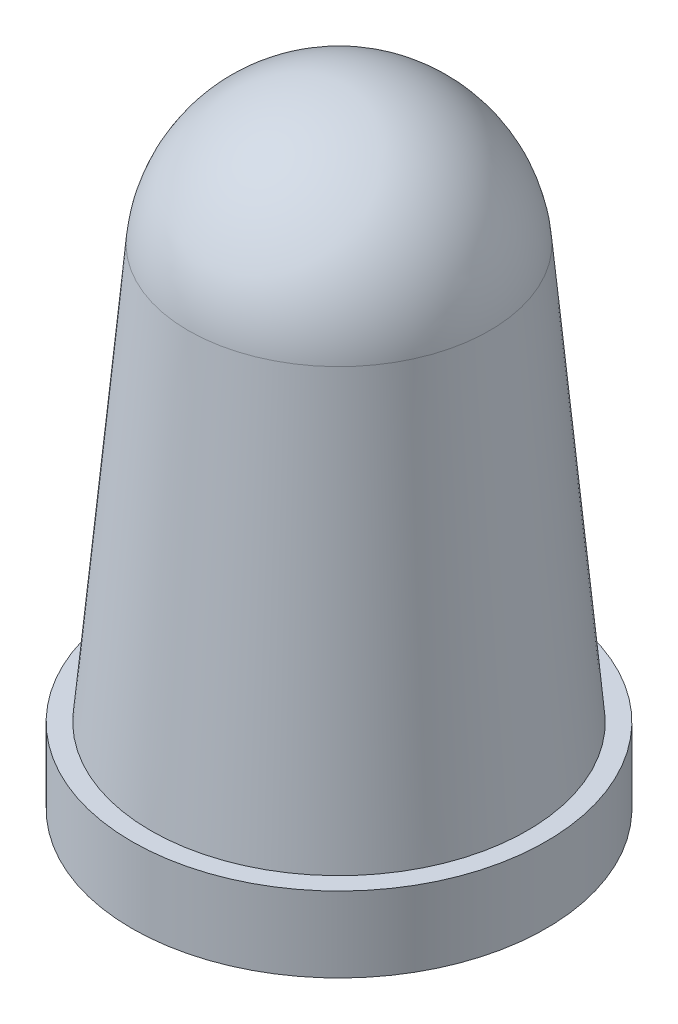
ISO-10303-21;
HEADER;
FILE_DESCRIPTION(('STEP AP214'),'2;1');
FILE_NAME('part.step','',(''),(''),'','','');
FILE_SCHEMA(('AUTOMOTIVE_DESIGN { 1 0 10303 214 1 1 1 1 }'));
ENDSEC;
DATA;
#1=APPLICATION_CONTEXT('core data for automotive mechanical design processes');
#2=APPLICATION_PROTOCOL_DEFINITION('international standard','automotive_design',2000,#1);
#3=PRODUCT_CONTEXT('',#1,'mechanical');
#4=PRODUCT('Part','Part','',(#3));
#5=PRODUCT_RELATED_PRODUCT_CATEGORY('part','',(#4));
#6=PRODUCT_DEFINITION_FORMATION('','',#4);
#7=PRODUCT_DEFINITION_CONTEXT('part definition',#1,'design');
#8=PRODUCT_DEFINITION('design','',#6,#7);
#9=PRODUCT_DEFINITION_SHAPE('','',#8);
#10=(LENGTH_UNIT() NAMED_UNIT(*) SI_UNIT(.MILLI.,.METRE.));
#11=(NAMED_UNIT(*) PLANE_ANGLE_UNIT() SI_UNIT($,.RADIAN.));
#12=(NAMED_UNIT(*) SI_UNIT($,.STERADIAN.) SOLID_ANGLE_UNIT());
#13=UNCERTAINTY_MEASURE_WITH_UNIT(LENGTH_MEASURE(1.E-05),#10,'distance_accuracy_value','');
#14=(GEOMETRIC_REPRESENTATION_CONTEXT(3) GLOBAL_UNCERTAINTY_ASSIGNED_CONTEXT((#13)) GLOBAL_UNIT_ASSIGNED_CONTEXT((#10,
#11,#12)) REPRESENTATION_CONTEXT('',''));
#15=CARTESIAN_POINT('',(0.,0.,0.));
#16=DIRECTION('',(0.,0.,1.));
#17=DIRECTION('',(1.,0.,0.));
#18=AXIS2_PLACEMENT_3D('',#15,#16,#17);
#19=CARTESIAN_POINT('',(0.,0.,0.));
#20=DIRECTION('',(0.,-1.,0.));
#21=DIRECTION('',(0.,0.,-1.));
#22=AXIS2_PLACEMENT_3D('',#19,#20,#21);
#23=PLANE('',#22);
#24=CARTESIAN_POINT('',(0.,0.,0.));
#25=DIRECTION('',(0.,-1.,0.));
#26=DIRECTION('',(0.,0.,-1.));
#27=AXIS2_PLACEMENT_3D('',#24,#25,#26);
#28=CIRCLE('',#27,2.75);
#29=CARTESIAN_POINT('',(0.,0.,-2.75));
#30=VERTEX_POINT('',#29);
#31=EDGE_CURVE('E11',#30,#30,#28,.T.);
#32=ORIENTED_EDGE('',*,*,#31,.T.);
#33=EDGE_LOOP('',(#32));
#34=FACE_BOUND('',#33,.T.);
#35=ADVANCED_FACE('F32',(#34),#23,.T.);
#36=CARTESIAN_POINT('',(0.,0.,0.));
#37=DIRECTION('',(0.,-1.,0.));
#38=DIRECTION('',(0.,0.,-1.));
#39=AXIS2_PLACEMENT_3D('',#36,#37,#38);
#40=CYLINDRICAL_SURFACE('',#39,2.75);
#41=CARTESIAN_POINT('',(0.,1.,0.));
#42=DIRECTION('',(0.,-1.,0.));
#43=DIRECTION('',(0.,0.,-1.));
#44=AXIS2_PLACEMENT_3D('',#41,#42,#43);
#45=CIRCLE('',#44,2.75);
#46=CARTESIAN_POINT('',(0.,1.,-2.75));
#47=VERTEX_POINT('',#46);
#48=EDGE_CURVE('E38',#47,#47,#45,.T.);
#49=ORIENTED_EDGE('',*,*,#48,.T.);
#50=EDGE_LOOP('',(#49));
#51=FACE_BOUND('',#50,.T.);
#52=ORIENTED_EDGE('',*,*,#31,.F.);
#53=EDGE_LOOP('',(#52));
#54=FACE_BOUND('',#53,.T.);
#55=ADVANCED_FACE('F57',(#51,#54),#40,.T.);
#56=CARTESIAN_POINT('',(2.75,1.,0.));
#57=DIRECTION('',(0.,1.,0.));
#58=DIRECTION('',(0.,0.,1.));
#59=AXIS2_PLACEMENT_3D('',#56,#57,#58);
#60=PLANE('',#59);
#61=CARTESIAN_POINT('',(0.,1.,0.));
#62=DIRECTION('',(0.,-1.,0.));
#63=DIRECTION('',(0.,0.,-1.));
#64=AXIS2_PLACEMENT_3D('',#61,#62,#63);
#65=CIRCLE('',#64,2.5);
#66=CARTESIAN_POINT('',(0.,1.,-2.5));
#67=VERTEX_POINT('',#66);
#68=EDGE_CURVE('E50',#67,#67,#65,.T.);
#69=ORIENTED_EDGE('',*,*,#68,.T.);
#70=EDGE_LOOP('',(#69));
#71=FACE_BOUND('',#70,.T.);
#72=ORIENTED_EDGE('',*,*,#48,.F.);
#73=EDGE_LOOP('',(#72));
#74=FACE_BOUND('',#73,.T.);
#75=ADVANCED_FACE('F60',(#71,#74),#60,.T.);
#76=CARTESIAN_POINT('',(0.,1.,0.));
#77=DIRECTION('',(0.,-1.,0.));
#78=DIRECTION('',(0.,0.,-1.));
#79=AXIS2_PLACEMENT_3D('',#76,#77,#78);
#80=CONICAL_SURFACE('',#79,2.5,0.090659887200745);
#81=CARTESIAN_POINT('',(0.,6.5,0.));
#82=DIRECTION('',(0.,-1.,0.));
#83=DIRECTION('',(0.,0.,-1.));
#84=AXIS2_PLACEMENT_3D('',#81,#82,#83);
#85=CIRCLE('',#84,2.);
#86=CARTESIAN_POINT('',(0.,6.5,-2.));
#87=VERTEX_POINT('',#86);
#88=EDGE_CURVE('E48',#87,#87,#85,.T.);
#89=ORIENTED_EDGE('',*,*,#88,.T.);
#90=EDGE_LOOP('',(#89));
#91=FACE_BOUND('',#90,.T.);
#92=ORIENTED_EDGE('',*,*,#68,.F.);
#93=EDGE_LOOP('',(#92));
#94=FACE_BOUND('',#93,.T.);
#95=ADVANCED_FACE('F44',(#91,#94),#80,.T.);
#96=CARTESIAN_POINT('',(0.,6.31892850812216,-0.00821358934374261));
#97=DIRECTION('',(-1.,0.,0.));
#98=DIRECTION('',(0.,0.,-1.));
#99=AXIS2_PLACEMENT_3D('',#96,#97,#98);
#100=CIRCLE('',#99,1.99999999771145);
#101=TRIMMED_CURVE('',#100,(PARAMETER_VALUE(-1.57490313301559)),
(PARAMETER_VALUE(1.57490313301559)),.T.,.PARAMETER.);
#102=CARTESIAN_POINT('',(0.,6.31892850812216,0.));
#103=DIRECTION('',(0.,-1.,0.));
#104=AXIS1_PLACEMENT('',#102,#103);
#105=SURFACE_OF_REVOLUTION('',#101,#104);
#106=CARTESIAN_POINT('',(0.,8.31891164,0.));
#107=VERTEX_POINT('',#106);
#108=VERTEX_LOOP('',#107);
#109=FACE_BOUND('',#108,.T.);
#110=ORIENTED_EDGE('',*,*,#88,.F.);
#111=EDGE_LOOP('',(#110));
#112=FACE_BOUND('',#111,.T.);
#113=ADVANCED_FACE('F41',(#109,#112),#105,.T.);
#114=CLOSED_SHELL('',(#35,#55,#75,#95,#113));
#115=MANIFOLD_SOLID_BREP('B2',#114);
#116=ADVANCED_BREP_SHAPE_REPRESENTATION('',(#18,#115),#14);
#117=SHAPE_DEFINITION_REPRESENTATION(#9,#116);
ENDSEC;
END-ISO-10303-21;
